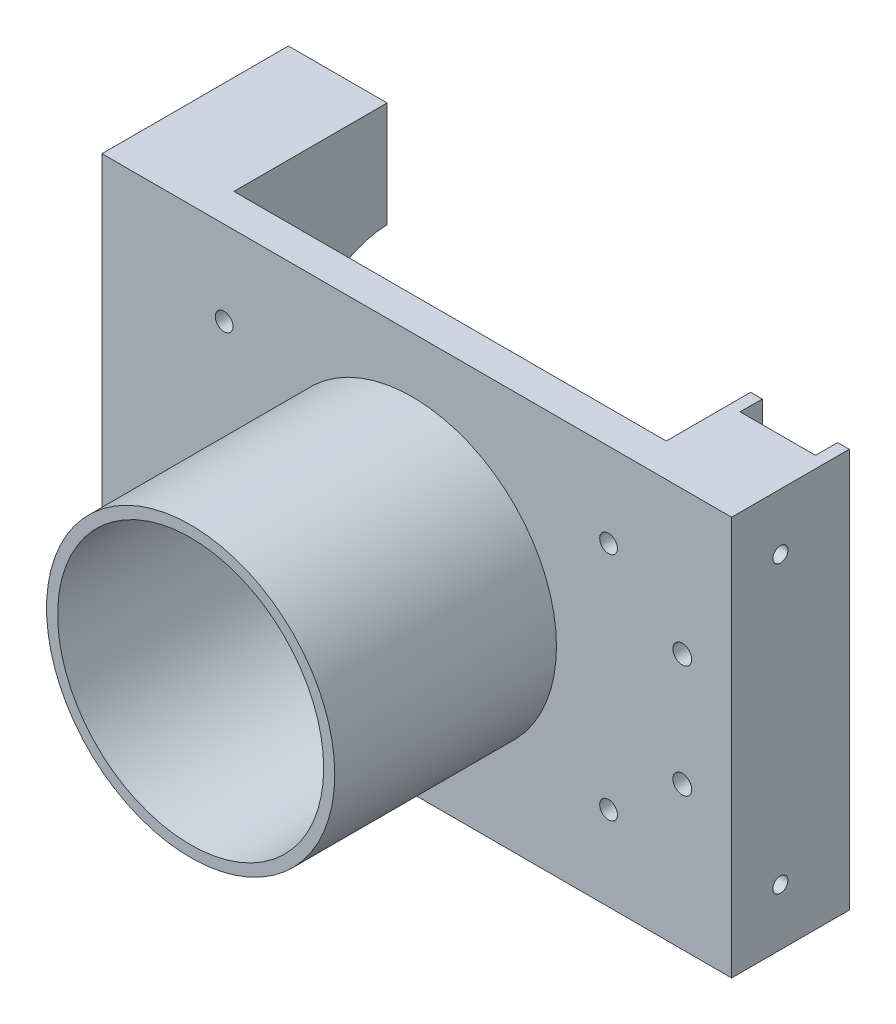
from build123d import *

# Parameters (mm, degrees)
ESQUISSE1_W                = 284
ESQUISSE1_H                = 180
EXTRUSION1_DEPTH           = 53.07
ESQUISSE2_R                = 65
ESQUISSE2_R_2              = 60
EXTRUSION3_DEPTH           = 100
D_POUILLE1_ANGLE           = 1
ESQUISSE3_W                = 195
ESQUISSE3_H                = 162
ENL_V_MAT_EXTRU_1_DEPTH    = 38.07
ESQUISSE16_R               = 4
ENL_V_MAT_EXTRU_15_DEPTH   = 15
R_P_TITION_LIN_AIRE3_COUNT = 2
R_P_TITION_LIN_AIRE3_PITCH = 173.4
ESQUISSE12_W               = 34
ESQUISSE12_H               = 140
ENL_V_MAT_EXTRU_4_DEPTH    = 10
ESQUISSE14_W               = 31.035
ESQUISSE14_H               = 180
EXTRUSION4_DEPTH           = 44.5
ESQUISSE13_R               = 42.5
ENL_V_MAT_EXTRU_5_DEPTH    = 44.5
ESQUISSE15_W               = 5
ESQUISSE15_H               = 10
ENL_V_MAT_EXTRU_14_DEPTH   = 44.5
ESQUISSE17_R               = 4.25
ENL_V_MAT_EXTRU_18_DEPTH   = 43.07
R_P_TITION_LIN_AIRE4_COUNT = 2
R_P_TITION_LIN_AIRE4_PITCH = 132.46
R_P_TITION_LIN_AIRE5_COUNT = 2
R_P_TITION_LIN_AIRE5_PITCH = 129


with BuildPart() as part:
    # Esquisse1 → Extrusion1 (new body)
    with BuildSketch(Plane.XY):
        with Locations((142, 90)):
            Rectangle(ESQUISSE1_W, ESQUISSE1_H)
    extrude(amount=EXTRUSION1_DEPTH)

    # Esquisse3 → Enl_v. mat.-Extru.1 (cut)
    with BuildSketch(Plane(origin=(0, 0, 0), x_dir=(-1, 0, 0), z_dir=(0, 0, -1))):
        with Locations((-142, 99)):
            Rectangle(ESQUISSE3_W, ESQUISSE3_H)
    extrude(amount=-ENL_V_MAT_EXTRU_1_DEPTH, mode=Mode.SUBTRACT)

    # Esquisse16 → Enl_v. mat.-Extru.15 (cut)
    with BuildSketch(Plane.XY.offset(53.07)):
        with Locations((55.1, 142)):
            Circle(ESQUISSE16_R)
        with Locations((55.1, 38)):
            Circle(ESQUISSE16_R)
    enl_v_mat_extru_15 = extrude(amount=-ENL_V_MAT_EXTRU_15_DEPTH, mode=Mode.SUBTRACT)

    # R_p_tition lin_aire3: Enl_v. mat.-Extru.15 ×2
    with Locations(*[(i * R_P_TITION_LIN_AIRE3_PITCH, 0, 0) for i in range(1, R_P_TITION_LIN_AIRE3_COUNT)]):
        add(enl_v_mat_extru_15, mode=Mode.SUBTRACT)

    # Esquisse12 → Enl_v. mat.-Extru.4 (cut)
    with BuildSketch(Plane(origin=(0, 0, 0), x_dir=(-1, 0, 0), z_dir=(0, 0, -1))):
        with Locations((-261.75, 110)):
            Rectangle(ESQUISSE12_W, ESQUISSE12_H)
    extrude(amount=-ENL_V_MAT_EXTRU_4_DEPTH, mode=Mode.SUBTRACT)

    # Esquisse14 → Extrusion4 (add)
    with BuildSketch(Plane.ZY):
        with Locations((-15.5175, 90)):
            Rectangle(ESQUISSE14_W, ESQUISSE14_H)
    extrude(amount=-EXTRUSION4_DEPTH)

    # Esquisse13 → Enl_v. mat.-Extru.5 (cut)
    with BuildSketch(Plane.ZY):
        with Locations((-32.93, 90)):
            Circle(ESQUISSE13_R)
    extrude(amount=-ENL_V_MAT_EXTRU_5_DEPTH, mode=Mode.SUBTRACT)

    # Esquisse15 → Enl_v. mat.-Extru.14 (cut)
    with BuildSketch(Plane.ZY):
        with Locations((11.77485754, 90)):
            Rectangle(ESQUISSE15_W, ESQUISSE15_H)
    extrude(amount=-ENL_V_MAT_EXTRU_14_DEPTH, mode=Mode.SUBTRACT)

    # Esquisse17 → Enl_v. mat.-Extru.18 (cut)
    with BuildSketch(Plane.XY.offset(53.07)):
        with Locations((261.75, 115.4)):
            Circle(ESQUISSE17_R)
        with Locations((261.75, 64.6)):
            Circle(ESQUISSE17_R)
    extrude(amount=-ENL_V_MAT_EXTRU_18_DEPTH, mode=Mode.SUBTRACT)

    # Esquisse20 → Trou taraud_ M82 (revolve, cut)
    with BuildSketch(Plane(origin=(22.25, 23.772268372, -31.035), x_dir=(0, 1, 0), z_dir=(1, 0, 0))):
        Polygon((0, 0), (0, 21.792926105), (3.4, 19.75), (3.4, 0), align=None)
    trou_taraud_m82 = revolve(axis=Axis((22.25, 23.772268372, -37.385), (0, 0, 1)), mode=Mode.SUBTRACT)

    # R_p_tition lin_aire4: Trou taraud_ M82 ×2
    with Locations(*[(0, i * R_P_TITION_LIN_AIRE4_PITCH, 0) for i in range(1, R_P_TITION_LIN_AIRE4_COUNT)]):
        add(trou_taraud_m82, mode=Mode.SUBTRACT)

    # Esquisse24 → Trou taraud_ M81 (revolve, cut)
    with BuildSketch(Plane(origin=(284, 154.5, 31.07), x_dir=(0, 0, -1), z_dir=(0, 1, 0))):
        Polygon((0, 0), (0, 24.292926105), (3.4, 22.25), (3.4, 0), align=None)
    trou_taraud_m81 = revolve(axis=Axis((290.35, 154.5, 31.07), (-1, 0, 0)), mode=Mode.SUBTRACT)

    # R_p_tition lin_aire5: Trou taraud_ M81 ×2
    with Locations(*[(0, -i * R_P_TITION_LIN_AIRE5_PITCH, 0) for i in range(1, R_P_TITION_LIN_AIRE5_COUNT)]):
        add(trou_taraud_m81, mode=Mode.SUBTRACT)


with BuildPart() as body_2:
    # Esquisse2 → Extrusion3 (new body)
    with BuildSketch(Plane.XY.offset(53.07)):
        with Locations((140, 90)):
            Circle(ESQUISSE2_R)
        with Locations((140, 90)):
            Circle(ESQUISSE2_R_2, mode=Mode.SUBTRACT)
    extrude(amount=EXTRUSION3_DEPTH)

    # D_pouille1
    d_pouille1_faces = [body_2.faces().sort_by_distance(p)[0] for p in [
        (80, 90, 103.07),
    ]]
    draft(d_pouille1_faces, Plane(origin=(140, 90, 153.07), x_dir=(1, 0, 0), z_dir=(0, 0, 1)), D_POUILLE1_ANGLE)


solid = Compound([part.part, body_2.part])
